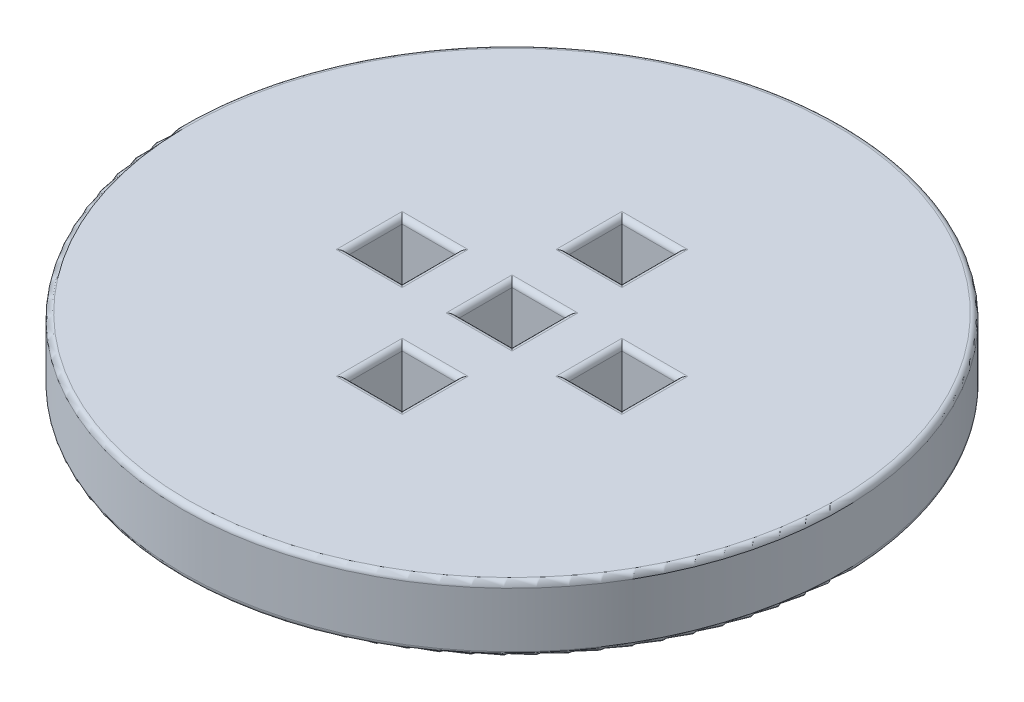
from build123d import *

# Parameters (mm, degrees)
SKETCH1_R           = 30
BOSS_EXTRUDE1_DEPTH = 6
SKETCH2_W           = 5
SKETCH2_H           = 5
CUT_EXTRUDE1_DEPTH  = 3
FILLET1_R           = 0.5
SKETCH4_W           = 5
SKETCH4_H           = 5
CUT_EXTRUDE2_DEPTH  = 3
FILLET2_R           = 0.5
FILLET3_R           = 0.5


with BuildPart() as part:
    # Sketch1 → Boss-Extrude1 (new body)
    with BuildSketch(Plane(origin=(0, 0, 0), x_dir=(1, 0, 0), z_dir=(0, 1, 0))):
        with Locations(Location((0, 0, 0), (0, 0, 270))):
            Circle(SKETCH1_R)
    extrude(amount=BOSS_EXTRUDE1_DEPTH)

    # Sketch2 → Cut-Extrude1 (cut)
    with BuildSketch(Plane(origin=(0, 6, 0), x_dir=(1, 0, 0), z_dir=(0, 1, 0))):
        with Locations((0, -10)):
            Rectangle(SKETCH2_W, SKETCH2_H)
        with Locations((-10, 0)):
            Rectangle(SKETCH2_W, SKETCH2_H)
        Rectangle(SKETCH2_W, SKETCH2_H)
        with Locations((0, 10)):
            Rectangle(SKETCH2_W, SKETCH2_H)
        with Locations((10, 0)):
            Rectangle(SKETCH2_W, SKETCH2_H)
    extrude(amount=-CUT_EXTRUDE1_DEPTH, mode=Mode.SUBTRACT)

    # Fillet1
    fillet1_edges = [part.edges().sort_by_distance(p)[0] for p in [
        (2.5, 6, 0),
        (0, 6, 2.5),
        (-12.5, 6, 0),
        (-10, 6, 2.5),
        (-7.5, 6, 0),
        (-10, 6, -2.5),
    ]]
    fillet(fillet1_edges, radius=FILLET1_R)

    # Sketch4 → Cut-Extrude2 (cut)
    with BuildSketch(Plane(origin=(0, 0, 0), x_dir=(-1, 0, 0), z_dir=(0, -1, 0))):
        Rectangle(SKETCH4_W, SKETCH4_H)
        with Locations((0, -10)):
            Rectangle(SKETCH4_W, SKETCH4_H)
        with Locations((10, 0)):
            Rectangle(SKETCH4_W, SKETCH4_H)
        with Locations((-10, 0)):
            Rectangle(SKETCH4_W, SKETCH4_H)
        with Locations((0, 10)):
            Rectangle(SKETCH4_W, SKETCH4_H)
    extrude(amount=-CUT_EXTRUDE2_DEPTH, mode=Mode.SUBTRACT)

    # Fillet2
    fillet2_edges = [part.edges().sort_by_distance(p)[0] for p in [
        (-2.5, 0, 0),
        (0, 0, -2.5),
        (2.5, 0, 0),
        (0, 0, 2.5),
        (-2.5, 0, 10),
        (0, 0, 7.5),
        (2.5, 0, 10),
        (0, 0, 12.5),
        (-12.5, 0, 0),
        (-10, 0, -2.5),
        (-7.5, 0, 0),
        (-10, 0, 2.5),
        (7.5, 0, 0),
        (10, 0, -2.5),
        (12.5, 0, 0),
        (10, 0, 2.5),
        (2.5, 0, -10),
        (0, 0, -7.5),
        (-2.5, 0, -10),
        (0, 0, -12.5),
        (0, 0, -30),
    ]]
    fillet(fillet2_edges, radius=FILLET2_R)

    # Fillet3
    fillet3_edges = [part.edges().sort_by_distance(p)[0] for p in [
        (0, 6, -30),
        (0, 6, 7.5),
        (-2.5, 6, 10),
        (0, 6, 12.5),
        (2.5, 6, 10),
        (-2.5, 6, 0.25),
        (0.25, 6, -2.5),
        (0, 6, -12.5),
        (-2.5, 6, -10),
        (0, 6, -7.5),
        (2.5, 6, -10),
        (10, 6, 2.5),
        (12.5, 6, 0),
        (10, 6, -2.5),
        (7.5, 6, 0),
    ]]
    fillet(fillet3_edges, radius=FILLET3_R)


solid = part.part
